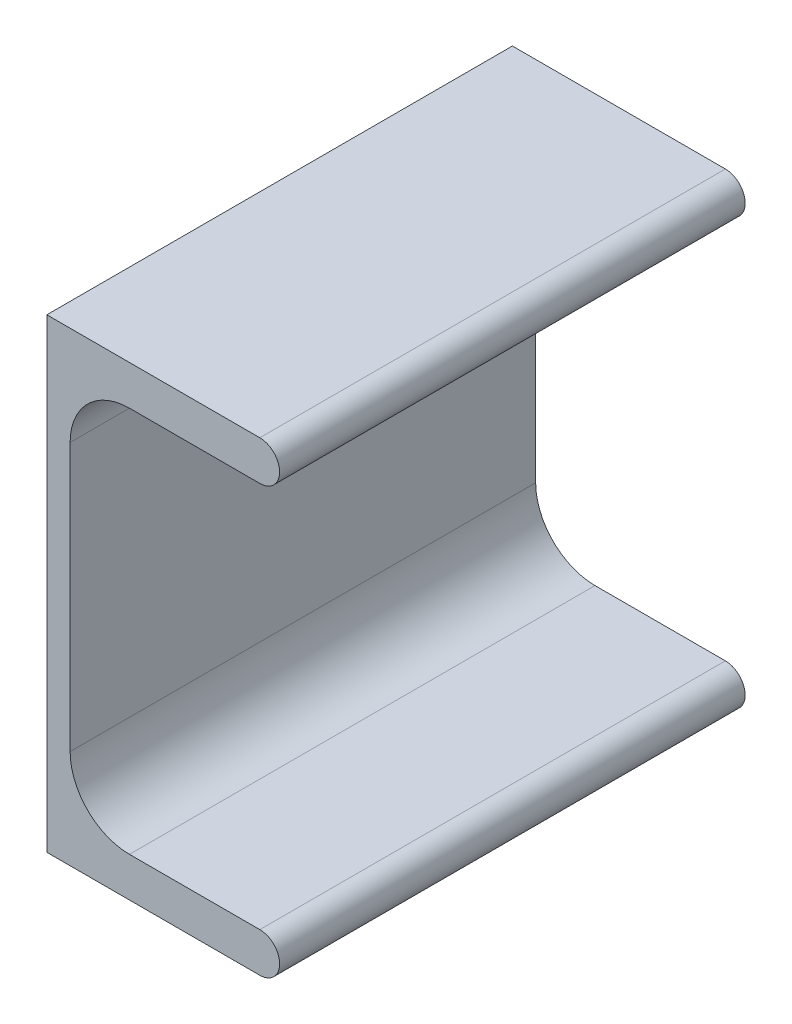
ISO-10303-21;
HEADER;
FILE_DESCRIPTION(('STEP AP214'),'2;1');
FILE_NAME('part.step','',(''),(''),'','','');
FILE_SCHEMA(('AUTOMOTIVE_DESIGN { 1 0 10303 214 1 1 1 1 }'));
ENDSEC;
DATA;
#1=APPLICATION_CONTEXT('core data for automotive mechanical design processes');
#2=APPLICATION_PROTOCOL_DEFINITION('international standard','automotive_design',2000,#1);
#3=PRODUCT_CONTEXT('',#1,'mechanical');
#4=PRODUCT('Part','Part','',(#3));
#5=PRODUCT_RELATED_PRODUCT_CATEGORY('part','',(#4));
#6=PRODUCT_DEFINITION_FORMATION('','',#4);
#7=PRODUCT_DEFINITION_CONTEXT('part definition',#1,'design');
#8=PRODUCT_DEFINITION('design','',#6,#7);
#9=PRODUCT_DEFINITION_SHAPE('','',#8);
#10=(LENGTH_UNIT() NAMED_UNIT(*) SI_UNIT(.MILLI.,.METRE.));
#11=(NAMED_UNIT(*) PLANE_ANGLE_UNIT() SI_UNIT($,.RADIAN.));
#12=(NAMED_UNIT(*) SI_UNIT($,.STERADIAN.) SOLID_ANGLE_UNIT());
#13=UNCERTAINTY_MEASURE_WITH_UNIT(LENGTH_MEASURE(1.E-05),#10,'distance_accuracy_value','');
#14=(GEOMETRIC_REPRESENTATION_CONTEXT(3) GLOBAL_UNCERTAINTY_ASSIGNED_CONTEXT((#13)) GLOBAL_UNIT_ASSIGNED_CONTEXT((#10,
#11,#12)) REPRESENTATION_CONTEXT('',''));
#15=CARTESIAN_POINT('',(0.,0.,0.));
#16=DIRECTION('',(0.,0.,1.));
#17=DIRECTION('',(1.,0.,0.));
#18=AXIS2_PLACEMENT_3D('',#15,#16,#17);
#19=CARTESIAN_POINT('',(0.,50.,50.));
#20=DIRECTION('',(1.,0.,0.));
#21=DIRECTION('',(0.,1.,0.));
#22=AXIS2_PLACEMENT_3D('',#19,#20,#21);
#23=PLANE('',#22);
#24=DIRECTION('',(0.,-1.,0.));
#25=VECTOR('',#24,1.);
#26=CARTESIAN_POINT('',(0.,50.,-50.));
#27=LINE('',#26,#25);
#28=CARTESIAN_POINT('',(0.,50.,-50.));
#29=VERTEX_POINT('',#28);
#30=CARTESIAN_POINT('',(0.,-50.,-50.));
#31=VERTEX_POINT('',#30);
#32=EDGE_CURVE('E140',#29,#31,#27,.T.);
#33=ORIENTED_EDGE('',*,*,#32,.T.);
#34=DIRECTION('',(0.,0.,-1.));
#35=VECTOR('',#34,1.);
#36=CARTESIAN_POINT('',(0.,-50.,50.));
#37=LINE('',#36,#35);
#38=CARTESIAN_POINT('',(0.,-50.,50.));
#39=VERTEX_POINT('',#38);
#40=EDGE_CURVE('E11',#39,#31,#37,.T.);
#41=ORIENTED_EDGE('',*,*,#40,.F.);
#42=DIRECTION('',(0.,-1.,0.));
#43=VECTOR('',#42,1.);
#44=CARTESIAN_POINT('',(0.,50.,50.));
#45=LINE('',#44,#43);
#46=CARTESIAN_POINT('',(0.,50.,50.));
#47=VERTEX_POINT('',#46);
#48=EDGE_CURVE('E158',#47,#39,#45,.T.);
#49=ORIENTED_EDGE('',*,*,#48,.F.);
#50=DIRECTION('',(0.,0.,-1.));
#51=VECTOR('',#50,1.);
#52=CARTESIAN_POINT('',(0.,50.,50.));
#53=LINE('',#52,#51);
#54=EDGE_CURVE('E136',#47,#29,#53,.T.);
#55=ORIENTED_EDGE('',*,*,#54,.T.);
#56=EDGE_LOOP('',(#33,#41,#49,#55));
#57=FACE_BOUND('',#56,.T.);
#58=ADVANCED_FACE('F32',(#57),#23,.F.);
#59=CARTESIAN_POINT('',(45.75,-49.9999999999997,50.));
#60=DIRECTION('',(0.,1.,0.));
#61=DIRECTION('',(-1.,0.,0.));
#62=AXIS2_PLACEMENT_3D('',#59,#60,#61);
#63=PLANE('',#62);
#64=DIRECTION('',(1.,0.,0.));
#65=VECTOR('',#64,1.);
#66=CARTESIAN_POINT('',(45.75,-49.9999999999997,-50.));
#67=LINE('',#66,#65);
#68=CARTESIAN_POINT('',(45.75,-49.9999999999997,-50.));
#69=VERTEX_POINT('',#68);
#70=EDGE_CURVE('E143',#31,#69,#67,.T.);
#71=ORIENTED_EDGE('',*,*,#70,.T.);
#72=DIRECTION('',(0.,0.,-1.));
#73=VECTOR('',#72,1.);
#74=CARTESIAN_POINT('',(45.75,-49.9999999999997,50.));
#75=LINE('',#74,#73);
#76=CARTESIAN_POINT('',(45.75,-49.9999999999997,50.));
#77=VERTEX_POINT('',#76);
#78=EDGE_CURVE('E40',#77,#69,#75,.T.);
#79=ORIENTED_EDGE('',*,*,#78,.F.);
#80=DIRECTION('',(1.,0.,0.));
#81=VECTOR('',#80,1.);
#82=CARTESIAN_POINT('',(45.75,-49.9999999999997,50.));
#83=LINE('',#82,#81);
#84=EDGE_CURVE('E97',#39,#77,#83,.T.);
#85=ORIENTED_EDGE('',*,*,#84,.F.);
#86=ORIENTED_EDGE('',*,*,#40,.T.);
#87=EDGE_LOOP('',(#71,#79,#85,#86));
#88=FACE_BOUND('',#87,.T.);
#89=ADVANCED_FACE('F207',(#88),#63,.F.);
#90=CARTESIAN_POINT('',(45.75,-45.7499999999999,50.));
#91=DIRECTION('',(0.,0.,-1.));
#92=DIRECTION('',(-1.,0.,0.));
#93=AXIS2_PLACEMENT_3D('',#90,#91,#92);
#94=CYLINDRICAL_SURFACE('',#93,4.24999999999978);
#95=CARTESIAN_POINT('',(45.75,-45.7499999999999,-50.));
#96=DIRECTION('',(0.,0.,1.));
#97=DIRECTION('',(1.,0.,0.));
#98=AXIS2_PLACEMENT_3D('',#95,#96,#97);
#99=CIRCLE('',#98,4.24999999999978);
#100=CARTESIAN_POINT('',(45.75,-41.5000000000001,-50.));
#101=VERTEX_POINT('',#100);
#102=EDGE_CURVE('E145',#69,#101,#99,.T.);
#103=ORIENTED_EDGE('',*,*,#102,.T.);
#104=DIRECTION('',(0.,0.,-1.));
#105=VECTOR('',#104,1.);
#106=CARTESIAN_POINT('',(45.75,-41.5000000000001,50.));
#107=LINE('',#106,#105);
#108=CARTESIAN_POINT('',(45.75,-41.5000000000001,50.));
#109=VERTEX_POINT('',#108);
#110=EDGE_CURVE('E171',#109,#101,#107,.T.);
#111=ORIENTED_EDGE('',*,*,#110,.F.);
#112=CARTESIAN_POINT('',(45.75,-45.7499999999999,50.));
#113=DIRECTION('',(0.,0.,1.));
#114=DIRECTION('',(1.,0.,0.));
#115=AXIS2_PLACEMENT_3D('',#112,#113,#114);
#116=CIRCLE('',#115,4.24999999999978);
#117=EDGE_CURVE('E179',#77,#109,#116,.T.);
#118=ORIENTED_EDGE('',*,*,#117,.F.);
#119=ORIENTED_EDGE('',*,*,#78,.T.);
#120=EDGE_LOOP('',(#103,#111,#118,#119));
#121=FACE_BOUND('',#120,.T.);
#122=ADVANCED_FACE('F177',(#121),#94,.T.);
#123=CARTESIAN_POINT('',(17.75,-41.5000000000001,50.));
#124=DIRECTION('',(0.,-1.,0.));
#125=DIRECTION('',(1.,0.,0.));
#126=AXIS2_PLACEMENT_3D('',#123,#124,#125);
#127=PLANE('',#126);
#128=DIRECTION('',(-1.,0.,0.));
#129=VECTOR('',#128,1.);
#130=CARTESIAN_POINT('',(17.75,-41.5000000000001,-50.));
#131=LINE('',#130,#129);
#132=CARTESIAN_POINT('',(17.75,-41.5000000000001,-50.));
#133=VERTEX_POINT('',#132);
#134=EDGE_CURVE('E147',#101,#133,#131,.T.);
#135=ORIENTED_EDGE('',*,*,#134,.T.);
#136=DIRECTION('',(0.,0.,-1.));
#137=VECTOR('',#136,1.);
#138=CARTESIAN_POINT('',(17.75,-41.5000000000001,50.));
#139=LINE('',#138,#137);
#140=CARTESIAN_POINT('',(17.75,-41.5000000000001,50.));
#141=VERTEX_POINT('',#140);
#142=EDGE_CURVE('E168',#141,#133,#139,.T.);
#143=ORIENTED_EDGE('',*,*,#142,.F.);
#144=DIRECTION('',(-1.,0.,0.));
#145=VECTOR('',#144,1.);
#146=CARTESIAN_POINT('',(17.75,-41.5000000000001,50.));
#147=LINE('',#146,#145);
#148=EDGE_CURVE('E197',#109,#141,#147,.T.);
#149=ORIENTED_EDGE('',*,*,#148,.F.);
#150=ORIENTED_EDGE('',*,*,#110,.T.);
#151=EDGE_LOOP('',(#135,#143,#149,#150));
#152=FACE_BOUND('',#151,.T.);
#153=ADVANCED_FACE('F188',(#152),#127,.F.);
#154=CARTESIAN_POINT('',(17.75,-28.7500000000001,50.));
#155=DIRECTION('',(0.,0.,-1.));
#156=DIRECTION('',(-1.,0.,0.));
#157=AXIS2_PLACEMENT_3D('',#154,#155,#156);
#158=CYLINDRICAL_SURFACE('',#157,12.75);
#159=CARTESIAN_POINT('',(17.75,-28.7500000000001,-50.));
#160=DIRECTION('',(0.,0.,-1.));
#161=DIRECTION('',(1.,0.,0.));
#162=AXIS2_PLACEMENT_3D('',#159,#160,#161);
#163=CIRCLE('',#162,12.75);
#164=CARTESIAN_POINT('',(5.00000000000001,-28.7500000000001,-50.));
#165=VERTEX_POINT('',#164);
#166=EDGE_CURVE('E149',#133,#165,#163,.T.);
#167=ORIENTED_EDGE('',*,*,#166,.T.);
#168=DIRECTION('',(0.,0.,-1.));
#169=VECTOR('',#168,1.);
#170=CARTESIAN_POINT('',(5.00000000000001,-28.7500000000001,50.));
#171=LINE('',#170,#169);
#172=CARTESIAN_POINT('',(5.00000000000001,-28.7500000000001,50.));
#173=VERTEX_POINT('',#172);
#174=EDGE_CURVE('E165',#173,#165,#171,.T.);
#175=ORIENTED_EDGE('',*,*,#174,.F.);
#176=CARTESIAN_POINT('',(17.75,-28.7500000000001,50.));
#177=DIRECTION('',(0.,0.,-1.));
#178=DIRECTION('',(1.,0.,0.));
#179=AXIS2_PLACEMENT_3D('',#176,#177,#178);
#180=CIRCLE('',#179,12.75);
#181=EDGE_CURVE('E194',#141,#173,#180,.T.);
#182=ORIENTED_EDGE('',*,*,#181,.F.);
#183=ORIENTED_EDGE('',*,*,#142,.T.);
#184=EDGE_LOOP('',(#167,#175,#182,#183));
#185=FACE_BOUND('',#184,.T.);
#186=ADVANCED_FACE('F192',(#185),#158,.F.);
#187=CARTESIAN_POINT('',(5.00000000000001,28.7500000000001,50.));
#188=DIRECTION('',(-1.,0.,0.));
#189=DIRECTION('',(0.,0.,1.));
#190=AXIS2_PLACEMENT_3D('',#187,#188,#189);
#191=PLANE('',#190);
#192=DIRECTION('',(0.,1.,0.));
#193=VECTOR('',#192,1.);
#194=CARTESIAN_POINT('',(5.00000000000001,28.7500000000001,-50.));
#195=LINE('',#194,#193);
#196=CARTESIAN_POINT('',(5.00000000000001,28.7500000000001,-50.));
#197=VERTEX_POINT('',#196);
#198=EDGE_CURVE('E151',#165,#197,#195,.T.);
#199=ORIENTED_EDGE('',*,*,#198,.T.);
#200=DIRECTION('',(0.,0.,-1.));
#201=VECTOR('',#200,1.);
#202=CARTESIAN_POINT('',(5.00000000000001,28.7500000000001,50.));
#203=LINE('',#202,#201);
#204=CARTESIAN_POINT('',(5.00000000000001,28.7500000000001,50.));
#205=VERTEX_POINT('',#204);
#206=EDGE_CURVE('E162',#205,#197,#203,.T.);
#207=ORIENTED_EDGE('',*,*,#206,.F.);
#208=DIRECTION('',(0.,1.,0.));
#209=VECTOR('',#208,1.);
#210=CARTESIAN_POINT('',(5.00000000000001,28.7500000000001,50.));
#211=LINE('',#210,#209);
#212=EDGE_CURVE('E196',#173,#205,#211,.T.);
#213=ORIENTED_EDGE('',*,*,#212,.F.);
#214=ORIENTED_EDGE('',*,*,#174,.T.);
#215=EDGE_LOOP('',(#199,#207,#213,#214));
#216=FACE_BOUND('',#215,.T.);
#217=ADVANCED_FACE('F219',(#216),#191,.F.);
#218=CARTESIAN_POINT('',(17.75,28.7500000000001,50.));
#219=DIRECTION('',(0.,0.,-1.));
#220=DIRECTION('',(-1.,0.,0.));
#221=AXIS2_PLACEMENT_3D('',#218,#219,#220);
#222=CYLINDRICAL_SURFACE('',#221,12.75);
#223=CARTESIAN_POINT('',(17.75,28.7500000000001,-50.));
#224=DIRECTION('',(0.,0.,-1.));
#225=DIRECTION('',(-1.,0.,0.));
#226=AXIS2_PLACEMENT_3D('',#223,#224,#225);
#227=CIRCLE('',#226,12.75);
#228=CARTESIAN_POINT('',(17.75,41.5000000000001,-50.));
#229=VERTEX_POINT('',#228);
#230=EDGE_CURVE('E153',#197,#229,#227,.T.);
#231=ORIENTED_EDGE('',*,*,#230,.T.);
#232=DIRECTION('',(0.,0.,-1.));
#233=VECTOR('',#232,1.);
#234=CARTESIAN_POINT('',(17.75,41.5000000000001,50.));
#235=LINE('',#234,#233);
#236=CARTESIAN_POINT('',(17.75,41.5000000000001,50.));
#237=VERTEX_POINT('',#236);
#238=EDGE_CURVE('E131',#237,#229,#235,.T.);
#239=ORIENTED_EDGE('',*,*,#238,.F.);
#240=CARTESIAN_POINT('',(17.75,28.7500000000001,50.));
#241=DIRECTION('',(0.,0.,-1.));
#242=DIRECTION('',(-1.,0.,0.));
#243=AXIS2_PLACEMENT_3D('',#240,#241,#242);
#244=CIRCLE('',#243,12.75);
#245=EDGE_CURVE('E122',#205,#237,#244,.T.);
#246=ORIENTED_EDGE('',*,*,#245,.F.);
#247=ORIENTED_EDGE('',*,*,#206,.T.);
#248=EDGE_LOOP('',(#231,#239,#246,#247));
#249=FACE_BOUND('',#248,.T.);
#250=ADVANCED_FACE('F222',(#249),#222,.F.);
#251=CARTESIAN_POINT('',(17.75,41.5000000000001,50.));
#252=DIRECTION('',(0.,1.,0.));
#253=DIRECTION('',(-1.,0.,0.));
#254=AXIS2_PLACEMENT_3D('',#251,#252,#253);
#255=PLANE('',#254);
#256=DIRECTION('',(1.,0.,0.));
#257=VECTOR('',#256,1.);
#258=CARTESIAN_POINT('',(17.75,41.5000000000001,-50.));
#259=LINE('',#258,#257);
#260=CARTESIAN_POINT('',(45.75,41.5000000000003,-50.));
#261=VERTEX_POINT('',#260);
#262=EDGE_CURVE('E130',#229,#261,#259,.T.);
#263=ORIENTED_EDGE('',*,*,#262,.T.);
#264=DIRECTION('',(0.,0.,-1.));
#265=VECTOR('',#264,1.);
#266=CARTESIAN_POINT('',(45.75,41.5000000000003,50.));
#267=LINE('',#266,#265);
#268=CARTESIAN_POINT('',(45.75,41.5000000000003,50.));
#269=VERTEX_POINT('',#268);
#270=EDGE_CURVE('E127',#269,#261,#267,.T.);
#271=ORIENTED_EDGE('',*,*,#270,.F.);
#272=DIRECTION('',(1.,0.,0.));
#273=VECTOR('',#272,1.);
#274=CARTESIAN_POINT('',(17.75,41.5000000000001,50.));
#275=LINE('',#274,#273);
#276=EDGE_CURVE('E116',#237,#269,#275,.T.);
#277=ORIENTED_EDGE('',*,*,#276,.F.);
#278=ORIENTED_EDGE('',*,*,#238,.T.);
#279=EDGE_LOOP('',(#263,#271,#277,#278));
#280=FACE_BOUND('',#279,.T.);
#281=ADVANCED_FACE('F128',(#280),#255,.F.);
#282=CARTESIAN_POINT('',(45.75,45.7500000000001,50.));
#283=DIRECTION('',(0.,0.,-1.));
#284=DIRECTION('',(-1.,0.,0.));
#285=AXIS2_PLACEMENT_3D('',#282,#283,#284);
#286=CYLINDRICAL_SURFACE('',#285,4.24999999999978);
#287=CARTESIAN_POINT('',(45.75,45.7500000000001,-50.));
#288=DIRECTION('',(0.,0.,1.));
#289=DIRECTION('',(1.,0.,0.));
#290=AXIS2_PLACEMENT_3D('',#287,#288,#289);
#291=CIRCLE('',#290,4.24999999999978);
#292=CARTESIAN_POINT('',(45.75,49.9999999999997,-50.));
#293=VERTEX_POINT('',#292);
#294=EDGE_CURVE('E83',#261,#293,#291,.T.);
#295=ORIENTED_EDGE('',*,*,#294,.T.);
#296=DIRECTION('',(0.,0.,-1.));
#297=VECTOR('',#296,1.);
#298=CARTESIAN_POINT('',(45.75,49.9999999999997,50.));
#299=LINE('',#298,#297);
#300=CARTESIAN_POINT('',(45.75,49.9999999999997,50.));
#301=VERTEX_POINT('',#300);
#302=EDGE_CURVE('E132',#301,#293,#299,.T.);
#303=ORIENTED_EDGE('',*,*,#302,.F.);
#304=CARTESIAN_POINT('',(45.75,45.7500000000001,50.));
#305=DIRECTION('',(0.,0.,1.));
#306=DIRECTION('',(1.,0.,0.));
#307=AXIS2_PLACEMENT_3D('',#304,#305,#306);
#308=CIRCLE('',#307,4.24999999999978);
#309=EDGE_CURVE('E120',#269,#301,#308,.T.);
#310=ORIENTED_EDGE('',*,*,#309,.F.);
#311=ORIENTED_EDGE('',*,*,#270,.T.);
#312=EDGE_LOOP('',(#295,#303,#310,#311));
#313=FACE_BOUND('',#312,.T.);
#314=ADVANCED_FACE('F134',(#313),#286,.T.);
#315=CARTESIAN_POINT('',(45.75,49.9999999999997,50.));
#316=DIRECTION('',(0.,-1.,0.));
#317=DIRECTION('',(1.,0.,0.));
#318=AXIS2_PLACEMENT_3D('',#315,#316,#317);
#319=PLANE('',#318);
#320=DIRECTION('',(-1.,0.,0.));
#321=VECTOR('',#320,1.);
#322=CARTESIAN_POINT('',(45.75,49.9999999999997,-50.));
#323=LINE('',#322,#321);
#324=EDGE_CURVE('E89',#293,#29,#323,.T.);
#325=ORIENTED_EDGE('',*,*,#324,.T.);
#326=ORIENTED_EDGE('',*,*,#54,.F.);
#327=DIRECTION('',(-1.,0.,0.));
#328=VECTOR('',#327,1.);
#329=CARTESIAN_POINT('',(45.75,49.9999999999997,50.));
#330=LINE('',#329,#328);
#331=EDGE_CURVE('E48',#301,#47,#330,.T.);
#332=ORIENTED_EDGE('',*,*,#331,.F.);
#333=ORIENTED_EDGE('',*,*,#302,.T.);
#334=EDGE_LOOP('',(#325,#326,#332,#333));
#335=FACE_BOUND('',#334,.T.);
#336=ADVANCED_FACE('F231',(#335),#319,.F.);
#337=CARTESIAN_POINT('',(45.75,-45.7499999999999,50.));
#338=DIRECTION('',(0.,0.,1.));
#339=DIRECTION('',(1.,0.,0.));
#340=AXIS2_PLACEMENT_3D('',#337,#338,#339);
#341=PLANE('',#340);
#342=ORIENTED_EDGE('',*,*,#48,.T.);
#343=ORIENTED_EDGE('',*,*,#84,.T.);
#344=ORIENTED_EDGE('',*,*,#117,.T.);
#345=ORIENTED_EDGE('',*,*,#148,.T.);
#346=ORIENTED_EDGE('',*,*,#181,.T.);
#347=ORIENTED_EDGE('',*,*,#212,.T.);
#348=ORIENTED_EDGE('',*,*,#245,.T.);
#349=ORIENTED_EDGE('',*,*,#276,.T.);
#350=ORIENTED_EDGE('',*,*,#309,.T.);
#351=ORIENTED_EDGE('',*,*,#331,.T.);
#352=EDGE_LOOP('',(#342,#343,#344,#345,#346,#347,#348,#349,#350,#351));
#353=FACE_BOUND('',#352,.T.);
#354=ADVANCED_FACE('F118',(#353),#341,.T.);
#355=CARTESIAN_POINT('',(45.75,-45.7499999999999,-50.));
#356=DIRECTION('',(0.,0.,1.));
#357=DIRECTION('',(1.,0.,0.));
#358=AXIS2_PLACEMENT_3D('',#355,#356,#357);
#359=PLANE('',#358);
#360=ORIENTED_EDGE('',*,*,#32,.F.);
#361=ORIENTED_EDGE('',*,*,#324,.F.);
#362=ORIENTED_EDGE('',*,*,#294,.F.);
#363=ORIENTED_EDGE('',*,*,#262,.F.);
#364=ORIENTED_EDGE('',*,*,#230,.F.);
#365=ORIENTED_EDGE('',*,*,#198,.F.);
#366=ORIENTED_EDGE('',*,*,#166,.F.);
#367=ORIENTED_EDGE('',*,*,#134,.F.);
#368=ORIENTED_EDGE('',*,*,#102,.F.);
#369=ORIENTED_EDGE('',*,*,#70,.F.);
#370=EDGE_LOOP('',(#360,#361,#362,#363,#364,#365,#366,#367,#368,#369));
#371=FACE_BOUND('',#370,.T.);
#372=ADVANCED_FACE('F183',(#371),#359,.F.);
#373=CLOSED_SHELL('',(#58,#89,#122,#153,#186,#217,#250,#281,#314,#336,#354,#372));
#374=MANIFOLD_SOLID_BREP('B2',#373);
#375=ADVANCED_BREP_SHAPE_REPRESENTATION('',(#18,#374),#14);
#376=SHAPE_DEFINITION_REPRESENTATION(#9,#375);
ENDSEC;
END-ISO-10303-21;
